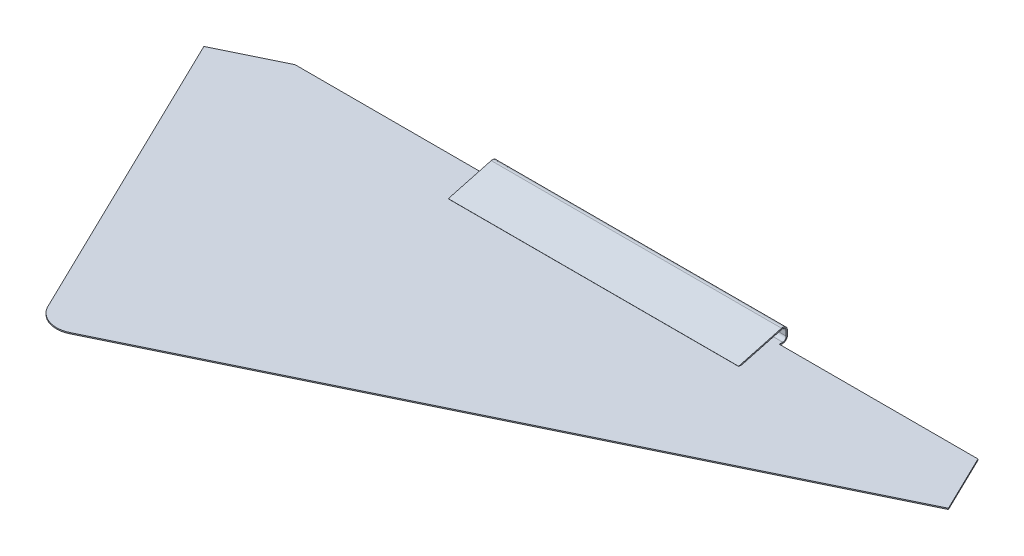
from build123d import *

# Parameters (mm, degrees)
BOSS_EXTRUDE1_DEPTH      = 1
BOSS_EXTRUDE2_DEPTH      = 125
BOSS_EXTRUDE2_DEPTH_BACK = 125


with BuildPart() as part:
    # Sketch2 → Boss-Extrude1 (new body)
    with BuildSketch(Plane(origin=(0, 0, 0), x_dir=(-1, 0, 0), z_dir=(0, 1, 0))):
        with BuildLine():
            Line((-320.161223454, 49.478447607), (-296.142830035, 0))
            Line((-296.142830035, 0), (291.963741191, 0))
            Line((291.963741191, 0), (344.824303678, 25.660178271))
            Line((344.824303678, 25.660178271), (218.181865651, 286.54653838))
            ThreePointArc((218.181865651, 286.54653838), (205.691826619, 297.638289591), (189.016982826, 296.649550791))
            Line((189.016982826, 296.649550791), (-320.161223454, 49.478447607))
        make_face()
    extrude(amount=BOSS_EXTRUDE1_DEPTH)

    # Sketch3 → Boss-Extrude2 (add, two sides: drawn at the far end of the back side and taken through both)
    with BuildSketch(Plane.YZ.offset(-BOSS_EXTRUDE2_DEPTH_BACK)):
        with BuildLine():
            Line((0, 0), (0, -3))
            ThreePointArc((0, -3), (1.171572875, -5.828427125), (4, -7))
            Line((4, -7), (8.082446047, -7))
            ThreePointArc((8.082446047, -7), (11.255859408, -5.435045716), (11.946149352, -1.96472382))
            Line((11.946149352, -1.96472382), (2.041481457, 35))
            Line((2.041481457, 35), (1.985295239, 34.984944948))
            ThreePointArc((1.985295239, 34.984944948), (1.851661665, 34.895653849), (1.8, 34.743463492))
            Line((1.8, 34.743463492), (1.8, 32.070430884))
            ThreePointArc((1.8, 32.070430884), (1.802138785, 32.037799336), (1.808518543, 32.005726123))
            Line((1.808518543, 32.005726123), (10.980223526, -2.223542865))
            ThreePointArc((10.980223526, -2.223542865), (10.462506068, -4.826284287), (8.082446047, -6))
            Line((8.082446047, -6), (4, -6))
            ThreePointArc((4, -6), (1.878679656, -5.121320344), (1, -3))
            Line((1, -3), (1, 0))
            Line((1, 0), (0, 0))
        make_face()
    extrude(amount=BOSS_EXTRUDE2_DEPTH + BOSS_EXTRUDE2_DEPTH_BACK)


solid = part.part
